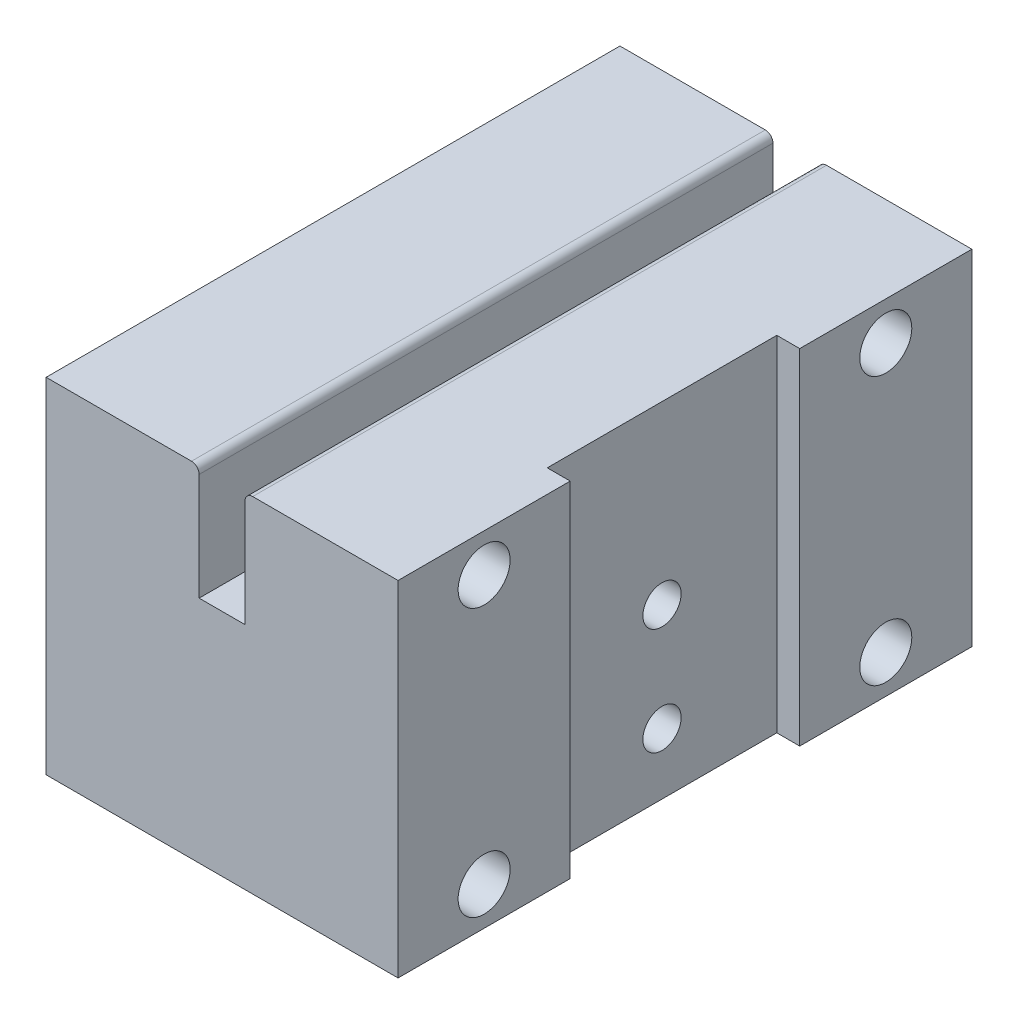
from build123d import *

# Parameters (mm, degrees)
SKETCH2_W               = 46
SKETCH2_H               = 45
BOSS_EXTRUDE1_DEPTH     = 37.5
CUT_EXTRUDE2_DEPTH      = 82.610354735
CUT_EXTRUDE2_DEPTH_BACK = 82.610354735
SKETCH3_W               = 6
SKETCH3_H               = 15
FILLET1_R               = 1
SKETCH5_W               = 30
SKETCH5_H               = 45
CUT_EXTRUDE3_DEPTH      = 3
SKETCH7_R               = 2.5
CUT_EXTRUDE4_DEPTH      = 20
SKETCH8_R               = 3.4
CUT_EXTRUDE5_DEPTH      = 15


with BuildPart() as part:
    # Sketch2 → Boss-Extrude1 (new, symmetric)
    with BuildSketch(Plane.XY):
        Rectangle(SKETCH2_W, SKETCH2_H)
    extrude(amount=BOSS_EXTRUDE1_DEPTH, both=True)

    # Sketch3 → Cut-Extrude2 (cut, two sides: drawn at the far end of the back side and taken through both)
    with BuildSketch(Plane.XY.offset(37.5).offset(-CUT_EXTRUDE2_DEPTH_BACK)):
        with Locations((0, 15)):
            Rectangle(SKETCH3_W, SKETCH3_H)
    extrude(amount=CUT_EXTRUDE2_DEPTH + CUT_EXTRUDE2_DEPTH_BACK, mode=Mode.SUBTRACT)

    # Fillet1
    fillet1_edges = [part.edges().sort_by_distance(p)[0] for p in [
        (-3, 22.5, 0),
        (3, 22.5, 0),
    ]]
    fillet(fillet1_edges, radius=FILLET1_R)

    # Sketch5 → Cut-Extrude3 (cut)
    with BuildSketch(Plane(origin=(23, 0, 0), x_dir=(0, 0, -1), z_dir=(1, 0, 0))):
        Rectangle(SKETCH5_W, SKETCH5_H)
    extrude(amount=-CUT_EXTRUDE3_DEPTH, mode=Mode.SUBTRACT)

    # Sketch7 → Cut-Extrude4 (cut)
    with BuildSketch(Plane(origin=(20, 0, 0), x_dir=(0, 0, -1), z_dir=(1, 0, 0))):
        with Locations(Location((0, -0.5, 0), (0, 0, 90))):
            Circle(SKETCH7_R)
        with Locations(Location((0, -14.5, 0), (0, 0, 90))):
            Circle(SKETCH7_R)
    extrude(amount=-CUT_EXTRUDE4_DEPTH, mode=Mode.SUBTRACT)

    # Sketch8 → Cut-Extrude5 (cut)
    with BuildSketch(Plane(origin=(23, 0, 0), x_dir=(0, 0, -1), z_dir=(1, 0, 0))):
        with Locations(Location((-26.25, 17.5, 0), (0, 0, 90))):
            Circle(SKETCH8_R)
        with Locations(Location((26.25, 17.5, 0), (0, 0, 90))):
            Circle(SKETCH8_R)
        with Locations(Location((26.25, -17.5, 0), (0, 0, 90))):
            Circle(SKETCH8_R)
        with Locations(Location((-26.25, -17.5, 0), (0, 0, 90))):
            Circle(SKETCH8_R)
    extrude(amount=-CUT_EXTRUDE5_DEPTH, mode=Mode.SUBTRACT)


solid = part.part
